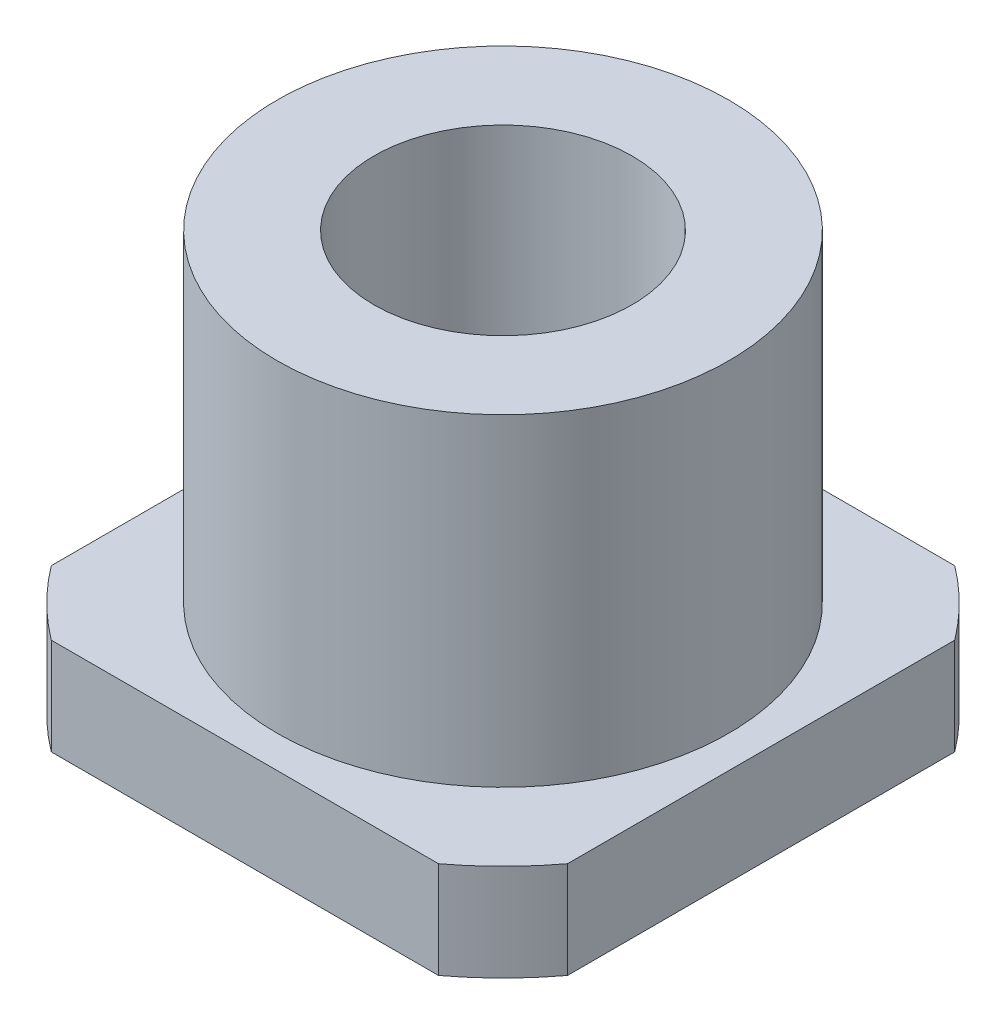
from build123d import *
from build123d.topology import SkipClean

# Parameters (mm, degrees)
SKETCH1_R           = 7
SKETCH1_R_2         = 4
BOSS_EXTRUDE1_DEPTH = 10
BOSS_EXTRUDE2_START = 3
SKETCH2_R           = 10
SKETCH2_R_2         = 4
BOSS_EXTRUDE2_DEPTH = 3
SKETCH7_W           = 25.33367733
SKETCH7_H           = 22.778656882
SKETCH7_W_2         = 16
SKETCH7_H_2         = 16
CUT_EXTRUDE1_DEPTH  = 10


with BuildPart() as part:
    # Sketch1 → Boss-Extrude1 (new body)
    with BuildSketch(Plane(origin=(0, 0, 0), x_dir=(1, 0, 0), z_dir=(0, 1, 0))):
        with Locations(Location((0, 0, 0), (0, 0, 270))):
            Circle(SKETCH1_R)
        with Locations(Location((0, 0, 0), (0, 0, 270))):
            Circle(SKETCH1_R_2, mode=Mode.SUBTRACT)
    extrude(amount=BOSS_EXTRUDE1_DEPTH)

    # Sketch2 → Boss-Extrude2 (add)
    with SkipClean():  # the faces are left unmerged after this step: merging them gives an invalid solid
        with BuildSketch(Plane.XZ.offset(BOSS_EXTRUDE2_START)):
            with Locations(Location((0, 0, 0), (0, 0, 270))):
                Circle(SKETCH2_R)
            with Locations(Location((0, 0, 0), (0, 0, 270))):
                Circle(SKETCH2_R_2, mode=Mode.SUBTRACT)
        extrude(amount=-BOSS_EXTRUDE2_DEPTH)

    # Sketch7 → Cut-Extrude1 (cut)
    with SkipClean():  # the faces are left unmerged after this step: merging them gives an invalid solid
        with BuildSketch(Plane.XZ.offset(3)):
            Rectangle(SKETCH7_W, SKETCH7_H)
            Rectangle(SKETCH7_W_2, SKETCH7_H_2, mode=Mode.SUBTRACT)
        extrude(amount=-CUT_EXTRUDE1_DEPTH, mode=Mode.SUBTRACT)


solid = part.part
